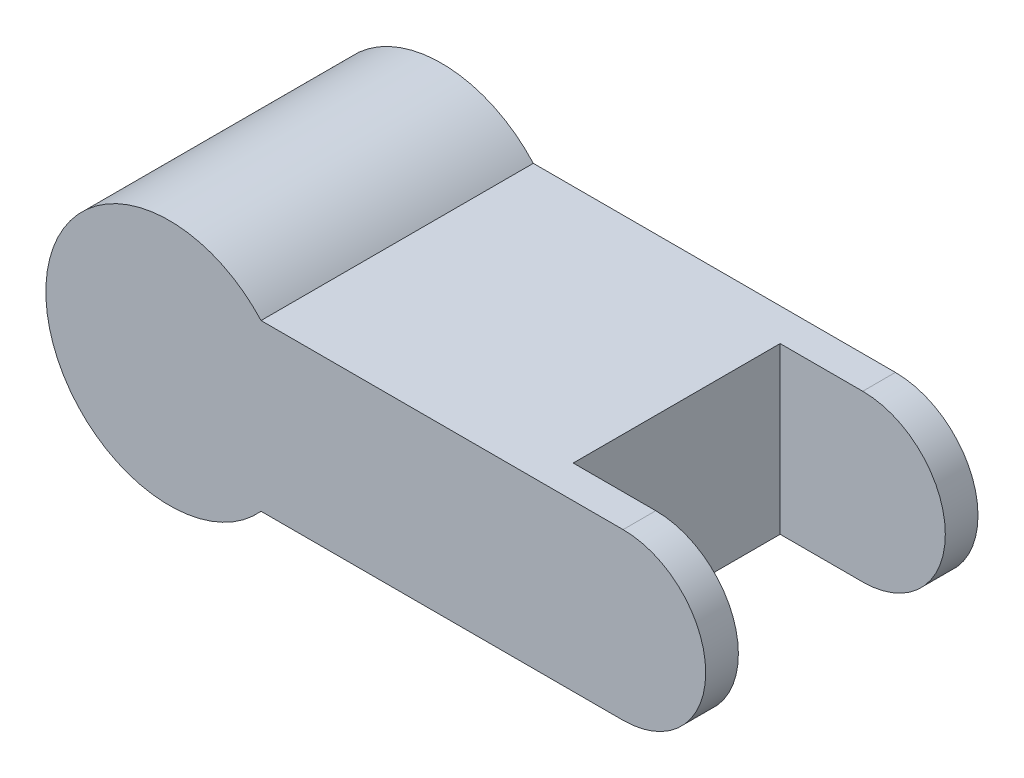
from build123d import *

# Parameters (mm, degrees)
BOSS_EXTRUDE1_DEPTH = 150
SKETCH2_W           = 91
SKETCH2_H           = 114
CUT_EXTRUDE1_DEPTH  = 91


with BuildPart() as part:
    # Sketch1 → Boss-Extrude1 (new body)
    with BuildSketch(Plane.XY):
        with BuildLine():
            Line((50.534641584, -45.5), (250, -45.5))
            ThreePointArc((250, -45.5), (295.5, 0), (250, 45.5))
            Line((250, 45.5), (50.534641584, 45.5))
            ThreePointArc((50.534641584, 45.5), (-68, 0), (50.534641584, -45.5))
        make_face()
    extrude(amount=-BOSS_EXTRUDE1_DEPTH)

    # Sketch2 → Cut-Extrude1 (cut)
    with BuildSketch(Plane(origin=(0, 45.5, 0), x_dir=(1, 0, 0), z_dir=(0, 1, 0))):
        with Locations((250, 75)):
            Rectangle(SKETCH2_W, SKETCH2_H)
    extrude(amount=-CUT_EXTRUDE1_DEPTH, mode=Mode.SUBTRACT)


solid = part.part
